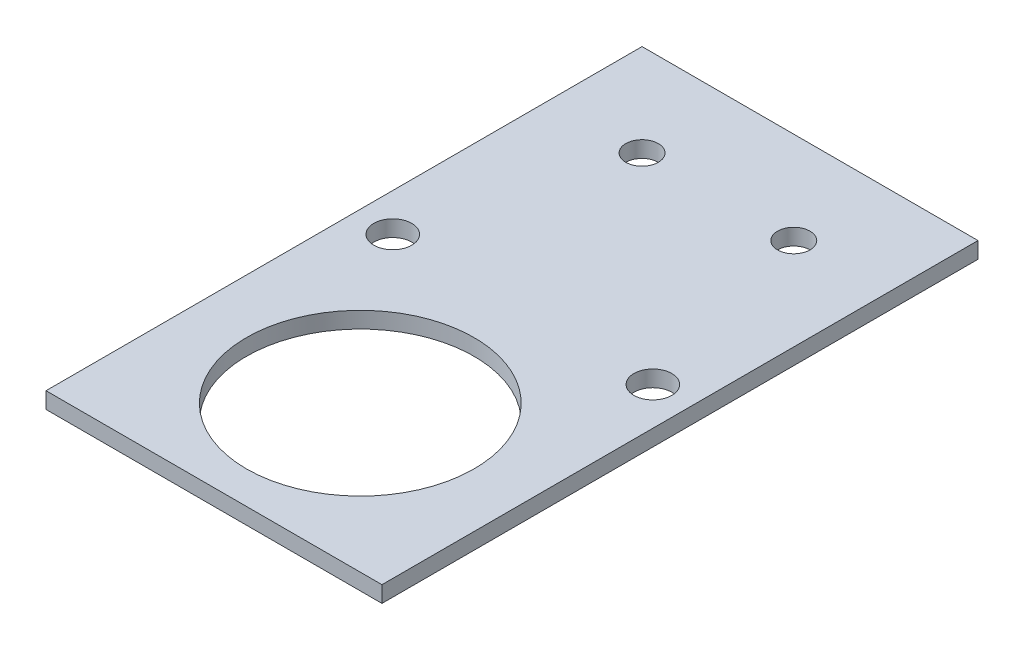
ISO-10303-21;
HEADER;
FILE_DESCRIPTION(('STEP AP214'),'2;1');
FILE_NAME('part.step','',(''),(''),'','','');
FILE_SCHEMA(('AUTOMOTIVE_DESIGN { 1 0 10303 214 1 1 1 1 }'));
ENDSEC;
DATA;
#1=APPLICATION_CONTEXT('core data for automotive mechanical design processes');
#2=APPLICATION_PROTOCOL_DEFINITION('international standard','automotive_design',2000,#1);
#3=PRODUCT_CONTEXT('',#1,'mechanical');
#4=PRODUCT('Part','Part','',(#3));
#5=PRODUCT_RELATED_PRODUCT_CATEGORY('part','',(#4));
#6=PRODUCT_DEFINITION_FORMATION('','',#4);
#7=PRODUCT_DEFINITION_CONTEXT('part definition',#1,'design');
#8=PRODUCT_DEFINITION('design','',#6,#7);
#9=PRODUCT_DEFINITION_SHAPE('','',#8);
#10=(LENGTH_UNIT() NAMED_UNIT(*) SI_UNIT(.MILLI.,.METRE.));
#11=(NAMED_UNIT(*) PLANE_ANGLE_UNIT() SI_UNIT($,.RADIAN.));
#12=(NAMED_UNIT(*) SI_UNIT($,.STERADIAN.) SOLID_ANGLE_UNIT());
#13=UNCERTAINTY_MEASURE_WITH_UNIT(LENGTH_MEASURE(1.E-05),#10,'distance_accuracy_value','');
#14=(GEOMETRIC_REPRESENTATION_CONTEXT(3) GLOBAL_UNCERTAINTY_ASSIGNED_CONTEXT((#13)) GLOBAL_UNIT_ASSIGNED_CONTEXT((#10,
#11,#12)) REPRESENTATION_CONTEXT('',''));
#15=CARTESIAN_POINT('',(0.,0.,0.));
#16=DIRECTION('',(0.,0.,1.));
#17=DIRECTION('',(1.,0.,0.));
#18=AXIS2_PLACEMENT_3D('',#15,#16,#17);
#19=CARTESIAN_POINT('',(0.,3.,-110.));
#20=DIRECTION('',(0.,-1.,0.));
#21=DIRECTION('',(0.,0.,-1.));
#22=AXIS2_PLACEMENT_3D('',#19,#20,#21);
#23=PLANE('',#22);
#24=CARTESIAN_POINT('',(17.,3.,-93.));
#25=DIRECTION('',(0.,1.,0.));
#26=DIRECTION('',(0.,0.,1.));
#27=AXIS2_PLACEMENT_3D('',#24,#25,#26);
#28=CIRCLE('',#27,3.);
#29=CARTESIAN_POINT('',(17.,3.,-90.));
#30=VERTEX_POINT('',#29);
#31=EDGE_CURVE('E129',#30,#30,#28,.T.);
#32=ORIENTED_EDGE('',*,*,#31,.F.);
#33=EDGE_LOOP('',(#32));
#34=FACE_BOUND('',#33,.T.);
#35=CARTESIAN_POINT('',(7.,3.,-57.));
#36=DIRECTION('',(0.,1.,0.));
#37=DIRECTION('',(0.,0.,1.));
#38=AXIS2_PLACEMENT_3D('',#35,#36,#37);
#39=CIRCLE('',#38,3.5);
#40=CARTESIAN_POINT('',(7.,3.,-53.5));
#41=VERTEX_POINT('',#40);
#42=EDGE_CURVE('E143',#41,#41,#39,.T.);
#43=ORIENTED_EDGE('',*,*,#42,.F.);
#44=EDGE_LOOP('',(#43));
#45=FACE_BOUND('',#44,.T.);
#46=DIRECTION('',(0.,0.,1.));
#47=VECTOR('',#46,1.);
#48=CARTESIAN_POINT('',(0.,3.,0.));
#49=LINE('',#48,#47);
#50=CARTESIAN_POINT('',(0.,3.,-110.));
#51=VERTEX_POINT('',#50);
#52=CARTESIAN_POINT('',(0.,3.,0.));
#53=VERTEX_POINT('',#52);
#54=EDGE_CURVE('E99',#51,#53,#49,.T.);
#55=ORIENTED_EDGE('',*,*,#54,.T.);
#56=DIRECTION('',(1.,0.,0.));
#57=VECTOR('',#56,1.);
#58=CARTESIAN_POINT('',(0.,3.,0.));
#59=LINE('',#58,#57);
#60=CARTESIAN_POINT('',(62.,3.,0.));
#61=VERTEX_POINT('',#60);
#62=EDGE_CURVE('E84',#53,#61,#59,.T.);
#63=ORIENTED_EDGE('',*,*,#62,.T.);
#64=DIRECTION('',(0.,0.,-1.));
#65=VECTOR('',#64,1.);
#66=CARTESIAN_POINT('',(62.,3.,0.));
#67=LINE('',#66,#65);
#68=CARTESIAN_POINT('',(62.,3.,-110.));
#69=VERTEX_POINT('',#68);
#70=EDGE_CURVE('E50',#61,#69,#67,.T.);
#71=ORIENTED_EDGE('',*,*,#70,.T.);
#72=DIRECTION('',(-1.,0.,0.));
#73=VECTOR('',#72,1.);
#74=CARTESIAN_POINT('',(0.,3.,-110.));
#75=LINE('',#74,#73);
#76=EDGE_CURVE('E45',#69,#51,#75,.T.);
#77=ORIENTED_EDGE('',*,*,#76,.T.);
#78=EDGE_LOOP('',(#55,#63,#71,#77));
#79=FACE_BOUND('',#78,.T.);
#80=CARTESIAN_POINT('',(31.,3.,-27.));
#81=DIRECTION('',(0.,1.,0.));
#82=DIRECTION('',(0.,0.,1.));
#83=AXIS2_PLACEMENT_3D('',#80,#81,#82);
#84=CIRCLE('',#83,21.);
#85=CARTESIAN_POINT('',(31.,3.,-6.));
#86=VERTEX_POINT('',#85);
#87=EDGE_CURVE('E89',#86,#86,#84,.T.);
#88=ORIENTED_EDGE('',*,*,#87,.F.);
#89=EDGE_LOOP('',(#88));
#90=FACE_BOUND('',#89,.T.);
#91=CARTESIAN_POINT('',(55.,3.,-57.));
#92=DIRECTION('',(0.,1.,0.));
#93=DIRECTION('',(0.,0.,1.));
#94=AXIS2_PLACEMENT_3D('',#91,#92,#93);
#95=CIRCLE('',#94,3.5);
#96=CARTESIAN_POINT('',(55.,3.,-53.5));
#97=VERTEX_POINT('',#96);
#98=EDGE_CURVE('E120',#97,#97,#95,.T.);
#99=ORIENTED_EDGE('',*,*,#98,.F.);
#100=EDGE_LOOP('',(#99));
#101=FACE_BOUND('',#100,.T.);
#102=CARTESIAN_POINT('',(45.,3.,-93.));
#103=DIRECTION('',(0.,1.,0.));
#104=DIRECTION('',(0.,0.,1.));
#105=AXIS2_PLACEMENT_3D('',#102,#103,#104);
#106=CIRCLE('',#105,3.);
#107=CARTESIAN_POINT('',(45.,3.,-90.));
#108=VERTEX_POINT('',#107);
#109=EDGE_CURVE('E123',#108,#108,#106,.T.);
#110=ORIENTED_EDGE('',*,*,#109,.F.);
#111=EDGE_LOOP('',(#110));
#112=FACE_BOUND('',#111,.T.);
#113=ADVANCED_FACE('F30',(#34,#45,#79,#90,#101,#112),#23,.F.);
#114=CARTESIAN_POINT('',(0.,0.,-110.));
#115=DIRECTION('',(0.,-1.,0.));
#116=DIRECTION('',(0.,0.,-1.));
#117=AXIS2_PLACEMENT_3D('',#114,#115,#116);
#118=PLANE('',#117);
#119=CARTESIAN_POINT('',(17.,0.,-93.));
#120=DIRECTION('',(0.,1.,0.));
#121=DIRECTION('',(0.,0.,1.));
#122=AXIS2_PLACEMENT_3D('',#119,#120,#121);
#123=CIRCLE('',#122,3.);
#124=CARTESIAN_POINT('',(17.,0.,-90.));
#125=VERTEX_POINT('',#124);
#126=EDGE_CURVE('E125',#125,#125,#123,.T.);
#127=ORIENTED_EDGE('',*,*,#126,.T.);
#128=EDGE_LOOP('',(#127));
#129=FACE_BOUND('',#128,.T.);
#130=CARTESIAN_POINT('',(7.,0.,-57.));
#131=DIRECTION('',(0.,1.,0.));
#132=DIRECTION('',(0.,0.,1.));
#133=AXIS2_PLACEMENT_3D('',#130,#131,#132);
#134=CIRCLE('',#133,3.5);
#135=CARTESIAN_POINT('',(7.,0.,-53.5));
#136=VERTEX_POINT('',#135);
#137=EDGE_CURVE('E140',#136,#136,#134,.T.);
#138=ORIENTED_EDGE('',*,*,#137,.T.);
#139=EDGE_LOOP('',(#138));
#140=FACE_BOUND('',#139,.T.);
#141=DIRECTION('',(0.,0.,1.));
#142=VECTOR('',#141,1.);
#143=CARTESIAN_POINT('',(0.,0.,0.));
#144=LINE('',#143,#142);
#145=CARTESIAN_POINT('',(0.,0.,-110.));
#146=VERTEX_POINT('',#145);
#147=CARTESIAN_POINT('',(0.,0.,0.));
#148=VERTEX_POINT('',#147);
#149=EDGE_CURVE('E76',#146,#148,#144,.T.);
#150=ORIENTED_EDGE('',*,*,#149,.F.);
#151=DIRECTION('',(-1.,0.,0.));
#152=VECTOR('',#151,1.);
#153=CARTESIAN_POINT('',(0.,0.,-110.));
#154=LINE('',#153,#152);
#155=CARTESIAN_POINT('',(62.,0.,-110.));
#156=VERTEX_POINT('',#155);
#157=EDGE_CURVE('E97',#156,#146,#154,.T.);
#158=ORIENTED_EDGE('',*,*,#157,.F.);
#159=DIRECTION('',(0.,0.,-1.));
#160=VECTOR('',#159,1.);
#161=CARTESIAN_POINT('',(62.,0.,0.));
#162=LINE('',#161,#160);
#163=CARTESIAN_POINT('',(62.,0.,0.));
#164=VERTEX_POINT('',#163);
#165=EDGE_CURVE('E77',#164,#156,#162,.T.);
#166=ORIENTED_EDGE('',*,*,#165,.F.);
#167=DIRECTION('',(1.,0.,0.));
#168=VECTOR('',#167,1.);
#169=CARTESIAN_POINT('',(0.,0.,0.));
#170=LINE('',#169,#168);
#171=EDGE_CURVE('E71',#148,#164,#170,.T.);
#172=ORIENTED_EDGE('',*,*,#171,.F.);
#173=EDGE_LOOP('',(#150,#158,#166,#172));
#174=FACE_BOUND('',#173,.T.);
#175=CARTESIAN_POINT('',(31.,0.,-27.));
#176=DIRECTION('',(0.,1.,0.));
#177=DIRECTION('',(0.,0.,1.));
#178=AXIS2_PLACEMENT_3D('',#175,#176,#177);
#179=CIRCLE('',#178,21.);
#180=CARTESIAN_POINT('',(31.,0.,-6.));
#181=VERTEX_POINT('',#180);
#182=EDGE_CURVE('E92',#181,#181,#179,.T.);
#183=ORIENTED_EDGE('',*,*,#182,.T.);
#184=EDGE_LOOP('',(#183));
#185=FACE_BOUND('',#184,.T.);
#186=CARTESIAN_POINT('',(55.,0.,-57.));
#187=DIRECTION('',(0.,1.,0.));
#188=DIRECTION('',(0.,0.,1.));
#189=AXIS2_PLACEMENT_3D('',#186,#187,#188);
#190=CIRCLE('',#189,3.5);
#191=CARTESIAN_POINT('',(55.,0.,-53.5));
#192=VERTEX_POINT('',#191);
#193=EDGE_CURVE('E136',#192,#192,#190,.T.);
#194=ORIENTED_EDGE('',*,*,#193,.T.);
#195=EDGE_LOOP('',(#194));
#196=FACE_BOUND('',#195,.T.);
#197=CARTESIAN_POINT('',(45.,0.,-93.));
#198=DIRECTION('',(0.,1.,0.));
#199=DIRECTION('',(0.,0.,1.));
#200=AXIS2_PLACEMENT_3D('',#197,#198,#199);
#201=CIRCLE('',#200,3.);
#202=CARTESIAN_POINT('',(45.,0.,-90.));
#203=VERTEX_POINT('',#202);
#204=EDGE_CURVE('E126',#203,#203,#201,.T.);
#205=ORIENTED_EDGE('',*,*,#204,.T.);
#206=EDGE_LOOP('',(#205));
#207=FACE_BOUND('',#206,.T.);
#208=ADVANCED_FACE('F72',(#129,#140,#174,#185,#196,#207),#118,.T.);
#209=CARTESIAN_POINT('',(0.,3.,0.));
#210=DIRECTION('',(1.,0.,0.));
#211=DIRECTION('',(0.,0.,-1.));
#212=AXIS2_PLACEMENT_3D('',#209,#210,#211);
#213=PLANE('',#212);
#214=ORIENTED_EDGE('',*,*,#149,.T.);
#215=DIRECTION('',(0.,-1.,0.));
#216=VECTOR('',#215,1.);
#217=CARTESIAN_POINT('',(0.,3.,0.));
#218=LINE('',#217,#216);
#219=EDGE_CURVE('E11',#53,#148,#218,.T.);
#220=ORIENTED_EDGE('',*,*,#219,.F.);
#221=ORIENTED_EDGE('',*,*,#54,.F.);
#222=DIRECTION('',(0.,-1.,0.));
#223=VECTOR('',#222,1.);
#224=CARTESIAN_POINT('',(0.,3.,-110.));
#225=LINE('',#224,#223);
#226=EDGE_CURVE('E88',#51,#146,#225,.T.);
#227=ORIENTED_EDGE('',*,*,#226,.T.);
#228=EDGE_LOOP('',(#214,#220,#221,#227));
#229=FACE_BOUND('',#228,.T.);
#230=ADVANCED_FACE('F32',(#229),#213,.F.);
#231=CARTESIAN_POINT('',(0.,3.,0.));
#232=DIRECTION('',(0.,0.,-1.));
#233=DIRECTION('',(-1.,0.,0.));
#234=AXIS2_PLACEMENT_3D('',#231,#232,#233);
#235=PLANE('',#234);
#236=ORIENTED_EDGE('',*,*,#171,.T.);
#237=DIRECTION('',(0.,-1.,0.));
#238=VECTOR('',#237,1.);
#239=CARTESIAN_POINT('',(62.,3.,0.));
#240=LINE('',#239,#238);
#241=EDGE_CURVE('E38',#61,#164,#240,.T.);
#242=ORIENTED_EDGE('',*,*,#241,.F.);
#243=ORIENTED_EDGE('',*,*,#62,.F.);
#244=ORIENTED_EDGE('',*,*,#219,.T.);
#245=EDGE_LOOP('',(#236,#242,#243,#244));
#246=FACE_BOUND('',#245,.T.);
#247=ADVANCED_FACE('F83',(#246),#235,.F.);
#248=CARTESIAN_POINT('',(62.,3.,0.));
#249=DIRECTION('',(-1.,0.,0.));
#250=DIRECTION('',(0.,0.,1.));
#251=AXIS2_PLACEMENT_3D('',#248,#249,#250);
#252=PLANE('',#251);
#253=ORIENTED_EDGE('',*,*,#165,.T.);
#254=DIRECTION('',(0.,-1.,0.));
#255=VECTOR('',#254,1.);
#256=CARTESIAN_POINT('',(62.,3.,-110.));
#257=LINE('',#256,#255);
#258=EDGE_CURVE('E105',#69,#156,#257,.T.);
#259=ORIENTED_EDGE('',*,*,#258,.F.);
#260=ORIENTED_EDGE('',*,*,#70,.F.);
#261=ORIENTED_EDGE('',*,*,#241,.T.);
#262=EDGE_LOOP('',(#253,#259,#260,#261));
#263=FACE_BOUND('',#262,.T.);
#264=ADVANCED_FACE('F108',(#263),#252,.F.);
#265=CARTESIAN_POINT('',(0.,3.,-110.));
#266=DIRECTION('',(0.,0.,1.));
#267=DIRECTION('',(1.,0.,0.));
#268=AXIS2_PLACEMENT_3D('',#265,#266,#267);
#269=PLANE('',#268);
#270=ORIENTED_EDGE('',*,*,#157,.T.);
#271=ORIENTED_EDGE('',*,*,#226,.F.);
#272=ORIENTED_EDGE('',*,*,#76,.F.);
#273=ORIENTED_EDGE('',*,*,#258,.T.);
#274=EDGE_LOOP('',(#270,#271,#272,#273));
#275=FACE_BOUND('',#274,.T.);
#276=ADVANCED_FACE('F110',(#275),#269,.F.);
#277=CARTESIAN_POINT('',(31.,3.,-27.));
#278=DIRECTION('',(0.,-1.,0.));
#279=DIRECTION('',(0.,0.,-1.));
#280=AXIS2_PLACEMENT_3D('',#277,#278,#279);
#281=CYLINDRICAL_SURFACE('',#280,21.);
#282=ORIENTED_EDGE('',*,*,#87,.T.);
#283=EDGE_LOOP('',(#282));
#284=FACE_BOUND('',#283,.T.);
#285=ORIENTED_EDGE('',*,*,#182,.F.);
#286=EDGE_LOOP('',(#285));
#287=FACE_BOUND('',#286,.T.);
#288=ADVANCED_FACE('F149',(#284,#287),#281,.F.);
#289=CARTESIAN_POINT('',(7.,3.,-57.));
#290=DIRECTION('',(0.,-1.,0.));
#291=DIRECTION('',(0.,0.,-1.));
#292=AXIS2_PLACEMENT_3D('',#289,#290,#291);
#293=CYLINDRICAL_SURFACE('',#292,3.5);
#294=ORIENTED_EDGE('',*,*,#42,.T.);
#295=EDGE_LOOP('',(#294));
#296=FACE_BOUND('',#295,.T.);
#297=ORIENTED_EDGE('',*,*,#137,.F.);
#298=EDGE_LOOP('',(#297));
#299=FACE_BOUND('',#298,.T.);
#300=ADVANCED_FACE('F151',(#296,#299),#293,.F.);
#301=CARTESIAN_POINT('',(55.,3.,-57.));
#302=DIRECTION('',(0.,-1.,0.));
#303=DIRECTION('',(0.,0.,-1.));
#304=AXIS2_PLACEMENT_3D('',#301,#302,#303);
#305=CYLINDRICAL_SURFACE('',#304,3.5);
#306=ORIENTED_EDGE('',*,*,#98,.T.);
#307=EDGE_LOOP('',(#306));
#308=FACE_BOUND('',#307,.T.);
#309=ORIENTED_EDGE('',*,*,#193,.F.);
#310=EDGE_LOOP('',(#309));
#311=FACE_BOUND('',#310,.T.);
#312=ADVANCED_FACE('F158',(#308,#311),#305,.F.);
#313=CARTESIAN_POINT('',(17.,3.,-93.));
#314=DIRECTION('',(0.,-1.,0.));
#315=DIRECTION('',(0.,0.,-1.));
#316=AXIS2_PLACEMENT_3D('',#313,#314,#315);
#317=CYLINDRICAL_SURFACE('',#316,3.);
#318=ORIENTED_EDGE('',*,*,#31,.T.);
#319=EDGE_LOOP('',(#318));
#320=FACE_BOUND('',#319,.T.);
#321=ORIENTED_EDGE('',*,*,#126,.F.);
#322=EDGE_LOOP('',(#321));
#323=FACE_BOUND('',#322,.T.);
#324=ADVANCED_FACE('F219',(#320,#323),#317,.F.);
#325=CARTESIAN_POINT('',(45.,3.,-93.));
#326=DIRECTION('',(0.,-1.,0.));
#327=DIRECTION('',(0.,0.,-1.));
#328=AXIS2_PLACEMENT_3D('',#325,#326,#327);
#329=CYLINDRICAL_SURFACE('',#328,3.);
#330=ORIENTED_EDGE('',*,*,#109,.T.);
#331=EDGE_LOOP('',(#330));
#332=FACE_BOUND('',#331,.T.);
#333=ORIENTED_EDGE('',*,*,#204,.F.);
#334=EDGE_LOOP('',(#333));
#335=FACE_BOUND('',#334,.T.);
#336=ADVANCED_FACE('F227',(#332,#335),#329,.F.);
#337=CLOSED_SHELL('',(#113,#208,#230,#247,#264,#276,#288,#300,#312,#324,#336));
#338=MANIFOLD_SOLID_BREP('B2',#337);
#339=ADVANCED_BREP_SHAPE_REPRESENTATION('',(#18,#338),#14);
#340=SHAPE_DEFINITION_REPRESENTATION(#9,#339);
ENDSEC;
END-ISO-10303-21;
